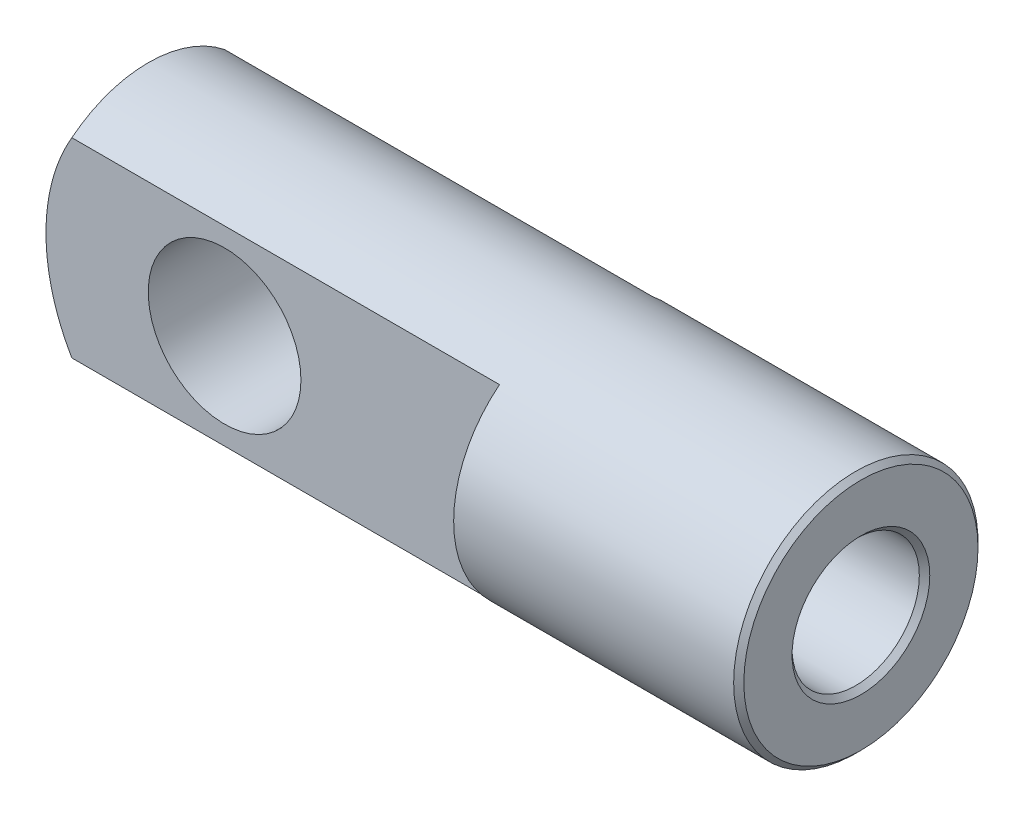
from build123d import *

# Parameters (mm, degrees)
CUT_EXTRUDE_1_DEPTH = 50
SKETCH_3_R          = 15
CUT_EXTRUDE_2_DEPTH = 30
M27X21_D            = 25
M27X21_DEPTH        = 35.5
M27X21_CSINK_D      = 27.05
M27X21_CSINK_ANGLE  = 90
M27X21_TIP          = 7.510757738


with BuildPart() as part:
    # Sketch 1 → Revolve 1 (revolve)
    with BuildSketch(Plane.XY, mode=Mode.PRIVATE) as revolve_1_sk:
        with BuildLine():
            Line((0, 0), (0, 23))
            Line((0, 23), (-1, 24))
            Line((-1, 24), (-140, 24))
            ThreePointArc((-140, 24), (-145.947331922, 12.649110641), (-148, 0))
            Line((-148, 0), (0, 0))
        make_face()
    revolve(revolve_1_sk.sketch.rotate(Axis((-148, 0, 0), (1, 0, 0)), 90), axis=Axis((-148, 0, 0), (1, 0, 0)))

    # Sketch 2 → Cut-Extrude 1 (cut)
    with BuildSketch(Plane(origin=(0, 20, 0), x_dir=(1, 0, 0), z_dir=(0, 1, 0))):
        Polygon((-148, -15), (-148, 15), (-56, 15), (-56, 26.185176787), (-165.106932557, 26.185176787), (-165.106932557, -26.185176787), (-56, -26.185176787), (-56, -15), align=None)
    extrude(amount=-CUT_EXTRUDE_1_DEPTH, mode=Mode.SUBTRACT)

    # Sketch 3 → Cut-Extrude 2 (cut)
    with BuildSketch(Plane.XY.offset(15)):
        with Locations((-110, 0)):
            Circle(SKETCH_3_R)
    extrude(amount=-CUT_EXTRUDE_2_DEPTH, mode=Mode.SUBTRACT)

    # M27x21
    with Locations(Plane(origin=(0, 0, 0), x_dir=(0, 0, -1), z_dir=(1, 0, 0))):
        with Locations((0, 0)):
            CounterSinkHole(M27X21_D / 2, M27X21_CSINK_D / 2, depth=M27X21_DEPTH, counter_sink_angle=M27X21_CSINK_ANGLE)
            with Locations((0, 0, -(M27X21_DEPTH + M27X21_TIP / 2))):  # 118° drill point
                Cone(0, M27X21_D / 2, M27X21_TIP, mode=Mode.SUBTRACT)


solid = part.part
